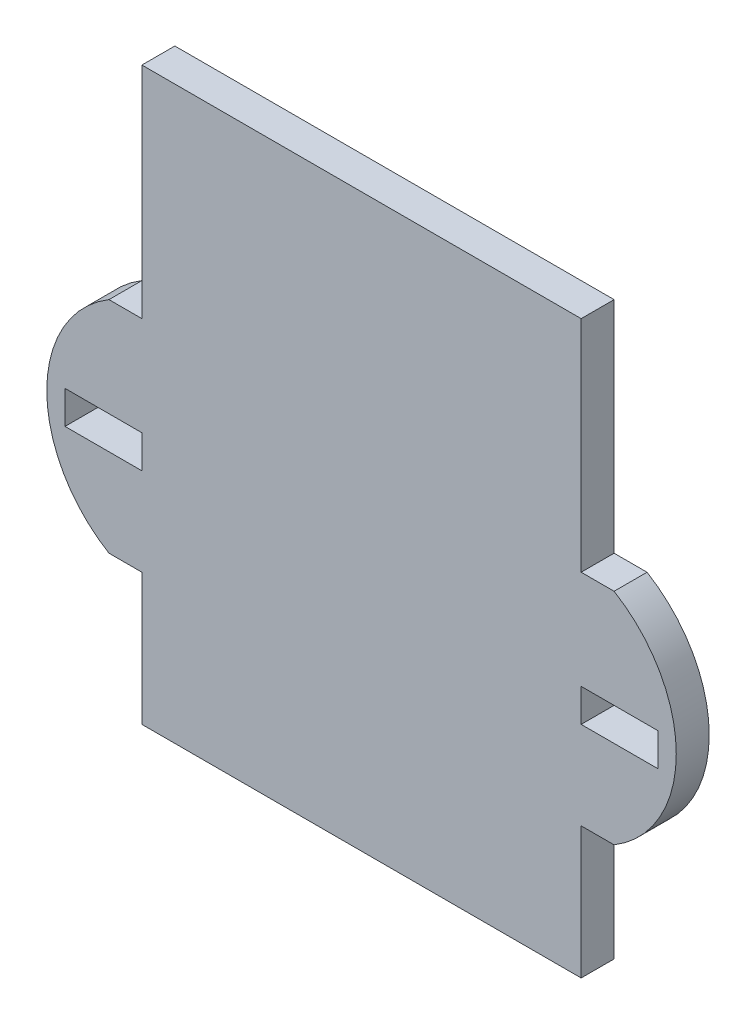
from build123d import *

# Parameters (mm, degrees)
ESQUISSE1_W        = 7
ESQUISSE1_H        = 3
BOSS_EXTRU_1_DEPTH = 3


with BuildPart() as part:
    # Esquisse1 → Boss.-Extru.1 (new body)
    with BuildSketch(Plane.XY):
        with BuildLine():
            Line((-18.614004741, 0), (-21.614004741, 0))
            ThreePointArc((-21.614004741, 0), (-27.275908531, 10), (-21.614004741, 20))
            Line((-21.614004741, 20), (-18.614004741, 20))
            Line((-18.614004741, 20), (-18.614004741, 40))
            Line((-18.614004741, 40), (21.385995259, 40))
            Line((21.385995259, 40), (21.385995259, 20))
            Line((21.385995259, 20), (24.385995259, 20))
            ThreePointArc((24.385995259, 20), (30.047899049, 10), (24.385995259, 0))
            Line((24.385995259, 0), (21.385995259, 0))
            Line((21.385995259, 0), (21.385995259, -12))
            Line((21.385995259, -12), (-18.614004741, -12))
            Line((-18.614004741, -12), (-18.614004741, 0))
        make_face()
        with Locations((-22.114004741, 9.5)):
            Rectangle(ESQUISSE1_W, ESQUISSE1_H, mode=Mode.SUBTRACT)
        with Locations((24.885995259, 9.5)):
            Rectangle(ESQUISSE1_W, ESQUISSE1_H, mode=Mode.SUBTRACT)
    extrude(amount=BOSS_EXTRU_1_DEPTH)


solid = part.part
